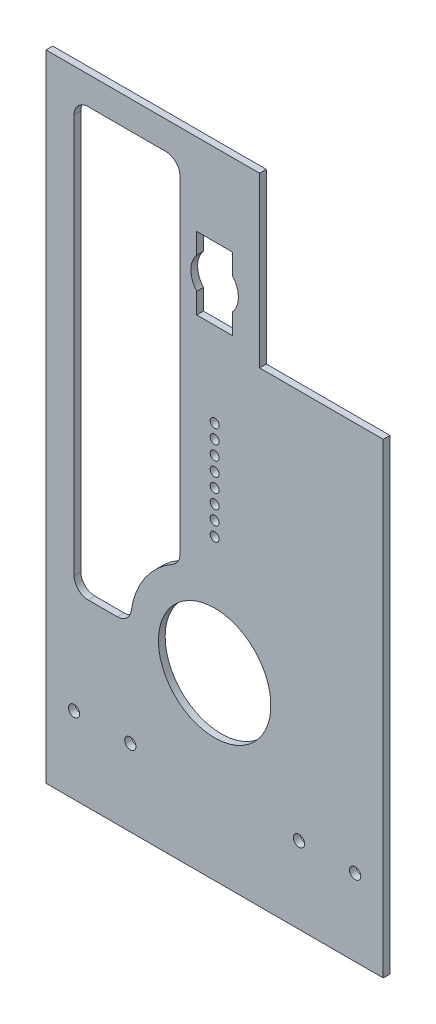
from build123d import *

# Parameters (mm, degrees)
SKETCH1_W           = 152.4
SKETCH1_H           = 292.1
BOSS_EXTRUDE1_DEPTH = 3.048
SKETCH2_R           = 25.4
SKETCH2_R_2         = 10.7315
SKETCH2_R_3         = 2.0193
SKETCH2_W           = 16.173788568
SKETCH2_H           = 32.6898
CUT_EXTRUDE1_DEPTH  = 165.761442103
SKETCH4_W           = 55.88
SKETCH4_H           = 76.2
CUT_EXTRUDE2_DEPTH  = 165.761442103
SKETCH5_R           = 2.54
CUT_EXTRUDE3_DEPTH  = 165.761442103
SKETCH6_W           = 152.4
SKETCH6_H           = 5.08
CUT_EXTRUDE4_DEPTH  = 165.761442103
CUT_EXTRUDE5_DEPTH  = 6.35
FILLET1_R           = 6.35


with BuildPart() as part:
    # Sketch1 → Boss-Extrude1 (new body)
    with BuildSketch(Plane.XY):
        Rectangle(SKETCH1_W, SKETCH1_H)
    extrude(amount=BOSS_EXTRUDE1_DEPTH)

    # Sketch2 → Cut-Extrude1 (cut, through all)
    with BuildSketch(Plane.XY):
        with Locations(Location((0, -59.69, 0), (0, 0, 180))):
            Circle(SKETCH2_R)
        with Locations((0, 92.71)):
            Circle(SKETCH2_R_2)
        with Locations(Location((0, 38.1, 0), (0, 0, 180))):
            Circle(SKETCH2_R_3)
        with Locations(Location((0, 31.75, 0), (0, 0, 180))):
            Circle(SKETCH2_R_3)
        with Locations(Location((0, 25.4, 0), (0, 0, 180))):
            Circle(SKETCH2_R_3)
        with Locations(Location((0, 19.05, 0), (0, 0, 180))):
            Circle(SKETCH2_R_3)
        with Locations(Location((0, 12.7, 0), (0, 0, 180))):
            Circle(SKETCH2_R_3)
        with Locations(Location((0, 6.35, 0), (0, 0, 180))):
            Circle(SKETCH2_R_3)
        with Locations(Location((0, 0, 0), (0, 0, 180))):
            Circle(SKETCH2_R_3)
        with Locations(Location((0, -6.35, 0), (0, 0, 180))):
            Circle(SKETCH2_R_3)
        with Locations((0, 92.71)):
            Rectangle(SKETCH2_W, SKETCH2_H)
    extrude(amount=CUT_EXTRUDE1_DEPTH, mode=Mode.SUBTRACT)

    # Sketch4 → Cut-Extrude2 (cut, through all)
    with BuildSketch(Plane.XY):
        with Locations((48.26, 107.95)):
            Rectangle(SKETCH4_W, SKETCH4_H)
    extrude(amount=CUT_EXTRUDE2_DEPTH, mode=Mode.SUBTRACT)

    # Sketch5 → Cut-Extrude3 (cut, through all)
    with BuildSketch(Plane(origin=(0, 0, 0), x_dir=(-1, 0, 0), z_dir=(0, 0, -1))):
        with Locations((-38.1, -106.299)):
            Circle(SKETCH5_R)
        with Locations((-63.5, -106.299)):
            Circle(SKETCH5_R)
        with Locations((63.5, -106.299)):
            Circle(SKETCH5_R)
        with Locations((38.1, -106.299)):
            Circle(SKETCH5_R)
    extrude(amount=-CUT_EXTRUDE3_DEPTH, mode=Mode.SUBTRACT)

    # Sketch6 → Cut-Extrude4 (cut, through all)
    with BuildSketch(Plane(origin=(0, 0, 0), x_dir=(-1, 0, 0), z_dir=(0, 0, -1))):
        with Locations((0, -143.51)):
            Rectangle(SKETCH6_W, SKETCH6_H)
    extrude(amount=-CUT_EXTRUDE4_DEPTH, mode=Mode.SUBTRACT)

    # Sketch7 → Cut-Extrude5 (cut)
    with BuildSketch(Plane(origin=(0, 0, 0), x_dir=(-1, 0, 0), z_dir=(0, 0, -1))):
        with BuildLine():
            Line((63.5, 133.35), (15.671209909, 133.35))
            Line((15.671209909, 133.35), (15.671209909, -24.962155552))
            ThreePointArc((15.671209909, -24.962155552), (32.005336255, -39.019527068), (38.1, -59.69))
            Line((38.1, -59.69), (63.5, -59.69))
            Line((63.5, -59.69), (63.5, 133.35))
        make_face()
    extrude(amount=-CUT_EXTRUDE5_DEPTH, mode=Mode.SUBTRACT)

    # Fillet1
    fillet1_edges = [part.edges().sort_by_distance(p)[0] for p in [
        (-38.1, -59.69, 1.524),
        (-15.671209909, -24.962155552, 1.524),
        (-15.671209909, 133.35, 1.524),
        (-63.5, 133.35, 1.524),
        (-63.5, -59.69, 1.524),
    ]]
    fillet(fillet1_edges, radius=FILLET1_R)


solid = part.part
